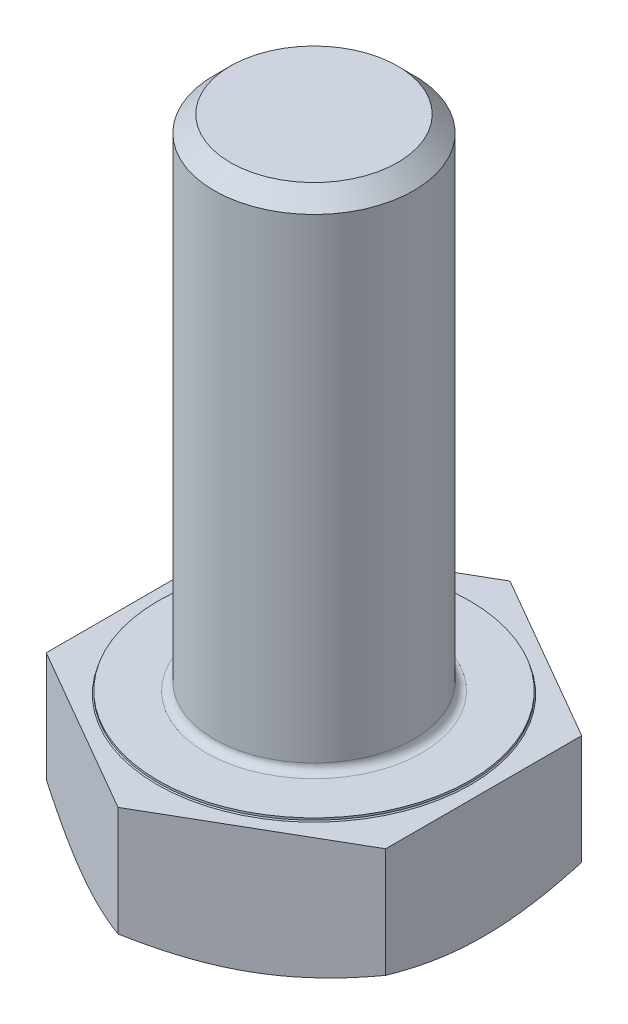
ISO-10303-21;
HEADER;
FILE_DESCRIPTION(('STEP AP214'),'2;1');
FILE_NAME('part.step','',(''),(''),'','','');
FILE_SCHEMA(('AUTOMOTIVE_DESIGN { 1 0 10303 214 1 1 1 1 }'));
ENDSEC;
DATA;
#1=APPLICATION_CONTEXT('core data for automotive mechanical design processes');
#2=APPLICATION_PROTOCOL_DEFINITION('international standard','automotive_design',2000,#1);
#3=PRODUCT_CONTEXT('',#1,'mechanical');
#4=PRODUCT('Part','Part','',(#3));
#5=PRODUCT_RELATED_PRODUCT_CATEGORY('part','',(#4));
#6=PRODUCT_DEFINITION_FORMATION('','',#4);
#7=PRODUCT_DEFINITION_CONTEXT('part definition',#1,'design');
#8=PRODUCT_DEFINITION('design','',#6,#7);
#9=PRODUCT_DEFINITION_SHAPE('','',#8);
#10=(LENGTH_UNIT() NAMED_UNIT(*) SI_UNIT(.MILLI.,.METRE.));
#11=(NAMED_UNIT(*) PLANE_ANGLE_UNIT() SI_UNIT($,.RADIAN.));
#12=(NAMED_UNIT(*) SI_UNIT($,.STERADIAN.) SOLID_ANGLE_UNIT());
#13=UNCERTAINTY_MEASURE_WITH_UNIT(LENGTH_MEASURE(1.E-05),#10,'distance_accuracy_value','');
#14=(GEOMETRIC_REPRESENTATION_CONTEXT(3) GLOBAL_UNCERTAINTY_ASSIGNED_CONTEXT((#13)) GLOBAL_UNIT_ASSIGNED_CONTEXT((#10,
#11,#12)) REPRESENTATION_CONTEXT('',''));
#15=CARTESIAN_POINT('',(0.,0.,0.));
#16=DIRECTION('',(0.,0.,1.));
#17=DIRECTION('',(1.,0.,0.));
#18=AXIS2_PLACEMENT_3D('',#15,#16,#17);
#19=CARTESIAN_POINT('',(0.,-6.4,0.));
#20=DIRECTION('',(0.,-1.,0.));
#21=DIRECTION('',(0.,0.,-1.));
#22=AXIS2_PLACEMENT_3D('',#19,#20,#21);
#23=PLANE('',#22);
#24=CARTESIAN_POINT('',(0.,-6.40000000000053,0.));
#25=DIRECTION('',(0.,1.,0.));
#26=DIRECTION('',(0.,0.,1.));
#27=AXIS2_PLACEMENT_3D('',#24,#25,#26);
#28=CIRCLE('',#27,8.5000000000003);
#29=CARTESIAN_POINT('',(-8.50000000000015,-6.40000000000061,0.));
#30=VERTEX_POINT('',#29);
#31=CARTESIAN_POINT('',(-4.25000000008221,-6.40000000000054,7.36121593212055));
#32=VERTEX_POINT('',#31);
#33=EDGE_CURVE('E174',#30,#32,#28,.T.);
#34=ORIENTED_EDGE('',*,*,#33,.F.);
#35=CARTESIAN_POINT('',(0.,-6.40000000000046,0.));
#36=DIRECTION('',(0.,1.,0.));
#37=DIRECTION('',(0.,0.,1.));
#38=AXIS2_PLACEMENT_3D('',#35,#36,#37);
#39=CIRCLE('',#38,8.50000000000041);
#40=CARTESIAN_POINT('',(-4.2499999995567,-6.4000000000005,-7.36121593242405));
#41=VERTEX_POINT('',#40);
#42=EDGE_CURVE('E59',#41,#30,#39,.T.);
#43=ORIENTED_EDGE('',*,*,#42,.F.);
#44=CARTESIAN_POINT('',(0.,-6.40000000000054,0.));
#45=DIRECTION('',(0.,1.,0.));
#46=DIRECTION('',(0.,0.,1.));
#47=AXIS2_PLACEMENT_3D('',#44,#45,#46);
#48=CIRCLE('',#47,8.50000000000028);
#49=CARTESIAN_POINT('',(4.25000000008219,-6.40000000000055,-7.36121593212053));
#50=VERTEX_POINT('',#49);
#51=EDGE_CURVE('E76',#50,#41,#48,.T.);
#52=ORIENTED_EDGE('',*,*,#51,.F.);
#53=CARTESIAN_POINT('',(0.,-6.40000000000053,0.));
#54=DIRECTION('',(0.,1.,0.));
#55=DIRECTION('',(0.,0.,1.));
#56=AXIS2_PLACEMENT_3D('',#53,#54,#55);
#57=CIRCLE('',#56,8.5000000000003);
#58=CARTESIAN_POINT('',(8.50000000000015,-6.40000000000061,0.));
#59=VERTEX_POINT('',#58);
#60=EDGE_CURVE('E74',#59,#50,#57,.T.);
#61=ORIENTED_EDGE('',*,*,#60,.F.);
#62=CARTESIAN_POINT('',(0.,-6.40000000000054,0.));
#63=DIRECTION('',(0.,1.,0.));
#64=DIRECTION('',(0.,0.,1.));
#65=AXIS2_PLACEMENT_3D('',#62,#63,#64);
#66=CIRCLE('',#65,8.50000000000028);
#67=CARTESIAN_POINT('',(4.25000000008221,-6.40000000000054,7.36121593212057));
#68=VERTEX_POINT('',#67);
#69=EDGE_CURVE('E175',#68,#59,#66,.T.);
#70=ORIENTED_EDGE('',*,*,#69,.F.);
#71=CARTESIAN_POINT('',(0.,-6.40000000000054,0.));
#72=DIRECTION('',(0.,1.,0.));
#73=DIRECTION('',(0.,0.,1.));
#74=AXIS2_PLACEMENT_3D('',#71,#72,#73);
#75=CIRCLE('',#74,8.50000000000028);
#76=EDGE_CURVE('E170',#32,#68,#75,.T.);
#77=ORIENTED_EDGE('',*,*,#76,.F.);
#78=EDGE_LOOP('',(#34,#43,#52,#61,#70,#77));
#79=FACE_BOUND('',#78,.T.);
#80=ADVANCED_FACE('F42',(#79),#23,.T.);
#81=CARTESIAN_POINT('',(0.,-5.63625548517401,0.));
#82=DIRECTION('',(0.,1.,0.));
#83=DIRECTION('',(0.,0.,1.));
#84=AXIS2_PLACEMENT_3D('',#81,#82,#83);
#85=CONICAL_SURFACE('',#84,9.82284430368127,1.0471975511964);
#86=CARTESIAN_POINT('',(8.50000000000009,-5.64081062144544,-4.90747728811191));
#87=CARTESIAN_POINT('',(8.154051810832,-5.75615561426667,-5.10721056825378));
#88=CARTESIAN_POINT('',(7.80533314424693,-5.86183176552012,-5.30854338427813));
#89=CARTESIAN_POINT('',(7.10482189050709,-6.04818975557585,-5.7129837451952));
#90=CARTESIAN_POINT('',(6.75305373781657,-6.12899518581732,-5.91607718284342));
#91=CARTESIAN_POINT('',(6.2220816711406,-6.22821053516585,-6.22263404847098));
#92=CARTESIAN_POINT('',(6.04442025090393,-6.25762889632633,-6.32520691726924));
#93=CARTESIAN_POINT('',(5.68824687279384,-6.30855269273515,-6.53084371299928));
#94=CARTESIAN_POINT('',(5.50973493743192,-6.33005833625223,-6.63390762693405));
#95=CARTESIAN_POINT('',(5.15120023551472,-6.36477884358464,-6.84090773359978));
#96=CARTESIAN_POINT('',(4.97117438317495,-6.37795154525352,-6.94484570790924));
#97=CARTESIAN_POINT('',(4.61076862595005,-6.39558035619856,-7.15292606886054));
#98=CARTESIAN_POINT('',(4.43038865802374,-6.40003473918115,-7.25706849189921));
#99=CARTESIAN_POINT('',(4.25000000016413,-6.40000000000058,-7.36121593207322));
#100=B_SPLINE_CURVE_WITH_KNOTS('',3,(#86,#87,#88,#89,#90,#91,#92,#93,#94,#95,#96,#97,#98,#99),
.UNSPECIFIED.,.F.,.F.,(4,2,2,2,2,2,4),(0.,1.24786231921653,2.4894195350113,3.11101273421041,
3.73258957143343,4.35728675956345,4.98210762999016),.UNSPECIFIED.);
#101=CARTESIAN_POINT('',(8.5,-5.64081062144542,-4.907477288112));
#102=VERTEX_POINT('',#101);
#103=EDGE_CURVE('E159',#102,#50,#100,.T.);
#104=ORIENTED_EDGE('',*,*,#103,.F.);
#105=CARTESIAN_POINT('',(8.5,-6.4000000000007,0.));
#106=CARTESIAN_POINT('',(8.5,-6.40003473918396,-0.208294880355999));
#107=CARTESIAN_POINT('',(8.5,-6.3955803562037,-0.416579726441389));
#108=CARTESIAN_POINT('',(8.5,-6.37795154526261,-0.832740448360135));
#109=CARTESIAN_POINT('',(8.5,-6.36477884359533,-1.04061639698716));
#110=CARTESIAN_POINT('',(8.5,-6.33005833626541,-1.4546166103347));
#111=CARTESIAN_POINT('',(8.5,-6.30855269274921,-1.66074443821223));
#112=CARTESIAN_POINT('',(8.5,-6.25762889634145,-2.07201802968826));
#113=CARTESIAN_POINT('',(8.5,-6.22821053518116,-2.27716376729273));
#114=CARTESIAN_POINT('',(8.5,-6.12899518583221,-2.89027749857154));
#115=CARTESIAN_POINT('',(8.5,-6.04818975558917,-3.29646437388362));
#116=CARTESIAN_POINT('',(8.5,-5.86183176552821,-4.10534509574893));
#117=CARTESIAN_POINT('',(8.5,-5.75615561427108,-4.50801072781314));
#118=CARTESIAN_POINT('',(8.5,-5.64081062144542,-4.90747728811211));
#119=B_SPLINE_CURVE_WITH_KNOTS('',3,(#105,#106,#107,#108,#109,#110,#111,#112,#113,#114,#115,
#116,#117,#118),.UNSPECIFIED.,.F.,.F.,(4,2,2,2,2,2,4),(0.,0.624820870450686,1.24951805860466,
1.87109489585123,2.49268809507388,3.73424531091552,4.98210763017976),.UNSPECIFIED.);
#120=EDGE_CURVE('E309',#59,#102,#119,.T.);
#121=ORIENTED_EDGE('',*,*,#120,.F.);
#122=ORIENTED_EDGE('',*,*,#60,.T.);
#123=EDGE_LOOP('',(#104,#121,#122));
#124=FACE_BOUND('',#123,.T.);
#125=ADVANCED_FACE('F315',(#124),#85,.T.);
#126=CARTESIAN_POINT('',(0.,-5.63625548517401,0.));
#127=DIRECTION('',(0.,1.,0.));
#128=DIRECTION('',(0.,0.,1.));
#129=AXIS2_PLACEMENT_3D('',#126,#127,#128);
#130=CONICAL_SURFACE('',#129,9.82284430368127,1.0471975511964);
#131=CARTESIAN_POINT('',(8.5,-5.64081062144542,4.90747728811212));
#132=CARTESIAN_POINT('',(8.5,-5.75615561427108,4.50801072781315));
#133=CARTESIAN_POINT('',(8.5,-5.86183176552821,4.10534509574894));
#134=CARTESIAN_POINT('',(8.5,-6.04818975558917,3.29646437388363));
#135=CARTESIAN_POINT('',(8.5,-6.12899518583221,2.89027749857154));
#136=CARTESIAN_POINT('',(8.5,-6.22821053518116,2.27716376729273));
#137=CARTESIAN_POINT('',(8.5,-6.25762889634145,2.07201802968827));
#138=CARTESIAN_POINT('',(8.5,-6.3085526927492,1.66074443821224));
#139=CARTESIAN_POINT('',(8.5,-6.33005833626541,1.45461661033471));
#140=CARTESIAN_POINT('',(8.5,-6.36477884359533,1.04061639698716));
#141=CARTESIAN_POINT('',(8.5,-6.37795154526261,0.832740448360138));
#142=CARTESIAN_POINT('',(8.5,-6.3955803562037,0.41657972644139));
#143=CARTESIAN_POINT('',(8.5,-6.40003473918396,0.208294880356));
#144=CARTESIAN_POINT('',(8.5,-6.4000000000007,0.));
#145=B_SPLINE_CURVE_WITH_KNOTS('',3,(#131,#132,#133,#134,#135,#136,#137,#138,#139,#140,#141,
#142,#143,#144),.UNSPECIFIED.,.F.,.F.,(4,2,2,2,2,2,4),(0.,1.24786231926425,2.48941953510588,
3.11101273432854,3.73258957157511,4.35728675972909,4.98210763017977),.UNSPECIFIED.);
#146=CARTESIAN_POINT('',(8.5,-5.64081062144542,4.907477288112));
#147=VERTEX_POINT('',#146);
#148=EDGE_CURVE('E269',#147,#59,#145,.T.);
#149=ORIENTED_EDGE('',*,*,#148,.F.);
#150=CARTESIAN_POINT('',(4.25000000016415,-6.40000000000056,7.36121593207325));
#151=CARTESIAN_POINT('',(4.43038865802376,-6.40003473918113,7.25706849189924));
#152=CARTESIAN_POINT('',(4.61076862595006,-6.39558035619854,7.15292606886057));
#153=CARTESIAN_POINT('',(4.97117438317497,-6.3779515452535,6.94484570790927));
#154=CARTESIAN_POINT('',(5.15120023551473,-6.36477884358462,6.84090773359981));
#155=CARTESIAN_POINT('',(5.50973493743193,-6.33005833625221,6.63390762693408));
#156=CARTESIAN_POINT('',(5.68824687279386,-6.30855269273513,6.53084371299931));
#157=CARTESIAN_POINT('',(6.04442025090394,-6.25762889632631,6.32520691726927));
#158=CARTESIAN_POINT('',(6.22208167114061,-6.22821053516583,6.22263404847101));
#159=CARTESIAN_POINT('',(6.75305373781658,-6.1289951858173,5.91607718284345));
#160=CARTESIAN_POINT('',(7.10482189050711,-6.04818975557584,5.71298374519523));
#161=CARTESIAN_POINT('',(7.80533314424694,-5.86183176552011,5.30854338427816));
#162=CARTESIAN_POINT('',(8.15405181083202,-5.75615561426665,5.10721056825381));
#163=CARTESIAN_POINT('',(8.50000000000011,-5.64081062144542,4.90747728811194));
#164=B_SPLINE_CURVE_WITH_KNOTS('',3,(#150,#151,#152,#153,#154,#155,#156,#157,#158,#159,#160,
#161,#162,#163),.UNSPECIFIED.,.F.,.F.,(4,2,2,2,2,2,4),(0.,0.624820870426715,1.24951805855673,
1.87109489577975,2.49268809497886,3.73424531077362,4.98210762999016),.UNSPECIFIED.);
#165=EDGE_CURVE('E244',#68,#147,#164,.T.);
#166=ORIENTED_EDGE('',*,*,#165,.F.);
#167=ORIENTED_EDGE('',*,*,#69,.T.);
#168=EDGE_LOOP('',(#149,#166,#167));
#169=FACE_BOUND('',#168,.T.);
#170=ADVANCED_FACE('F277',(#169),#130,.T.);
#171=CARTESIAN_POINT('',(0.,-5.63625548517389,0.));
#172=DIRECTION('',(0.,1.,0.));
#173=DIRECTION('',(0.,0.,1.));
#174=AXIS2_PLACEMENT_3D('',#171,#172,#173);
#175=CONICAL_SURFACE('',#174,9.82284430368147,1.0471975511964);
#176=CARTESIAN_POINT('',(0.,-5.64081062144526,9.81495457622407));
#177=CARTESIAN_POINT('',(0.34594818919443,-5.75615561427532,9.61522129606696));
#178=CARTESIAN_POINT('',(0.694666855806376,-5.86183176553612,9.4138884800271));
#179=CARTESIAN_POINT('',(1.39517810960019,-6.04818975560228,9.00944811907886));
#180=CARTESIAN_POINT('',(1.74694626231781,-6.12899518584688,8.806354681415));
#181=CARTESIAN_POINT('',(2.27791832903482,-6.22821053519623,8.49979781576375));
#182=CARTESIAN_POINT('',(2.45557974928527,-6.25762889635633,8.39722494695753));
#183=CARTESIAN_POINT('',(2.81175312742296,-6.30855269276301,8.19158815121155));
#184=CARTESIAN_POINT('',(2.99026506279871,-6.33005833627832,8.08852423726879));
#185=CARTESIAN_POINT('',(3.34879976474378,-6.36477884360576,7.88152413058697));
#186=CARTESIAN_POINT('',(3.52882561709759,-6.37795154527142,7.77758615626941));
#187=CARTESIAN_POINT('',(3.88923137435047,-6.39558035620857,7.56950579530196));
#188=CARTESIAN_POINT('',(4.0696113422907,-6.4000347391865,7.46536337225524));
#189=CARTESIAN_POINT('',(4.25000000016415,-6.40000000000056,7.36121593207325));
#190=B_SPLINE_CURVE_WITH_KNOTS('',3,(#176,#177,#178,#179,#180,#181,#182,#183,#184,#185,#186,
#187,#188,#189),.UNSPECIFIED.,.F.,.F.,(4,2,2,2,2,2,4),(0.,1.24786231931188,2.4894195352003,
3.11101273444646,3.73258957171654,4.35728675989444,4.98210763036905),.UNSPECIFIED.);
#191=CARTESIAN_POINT('',(0.,-5.64081062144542,9.814954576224));
#192=VERTEX_POINT('',#191);
#193=EDGE_CURVE('E287',#192,#68,#190,.T.);
#194=ORIENTED_EDGE('',*,*,#193,.F.);
#195=CARTESIAN_POINT('',(-4.25000000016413,-6.40000000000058,7.36121593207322));
#196=CARTESIAN_POINT('',(-4.06961134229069,-6.40003473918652,7.46536337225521));
#197=CARTESIAN_POINT('',(-3.88923137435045,-6.39558035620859,7.56950579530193));
#198=CARTESIAN_POINT('',(-3.52882561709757,-6.37795154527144,7.77758615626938));
#199=CARTESIAN_POINT('',(-3.34879976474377,-6.36477884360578,7.88152413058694));
#200=CARTESIAN_POINT('',(-2.9902650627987,-6.33005833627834,8.08852423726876));
#201=CARTESIAN_POINT('',(-2.81175312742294,-6.30855269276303,8.19158815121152));
#202=CARTESIAN_POINT('',(-2.45557974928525,-6.25762889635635,8.39722494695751));
#203=CARTESIAN_POINT('',(-2.2779183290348,-6.22821053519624,8.49979781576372));
#204=CARTESIAN_POINT('',(-1.74694626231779,-6.1289951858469,8.80635468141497));
#205=CARTESIAN_POINT('',(-1.39517810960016,-6.0481897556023,9.00944811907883));
#206=CARTESIAN_POINT('',(-0.694666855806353,-5.86183176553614,9.41388848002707));
#207=CARTESIAN_POINT('',(-0.345948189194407,-5.75615561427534,9.61522129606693));
#208=CARTESIAN_POINT('',(0.,-5.64081062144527,9.81495457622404));
#209=B_SPLINE_CURVE_WITH_KNOTS('',3,(#195,#196,#197,#198,#199,#200,#201,#202,#203,#204,#205,
#206,#207,#208),.UNSPECIFIED.,.F.,.F.,(4,2,2,2,2,2,4),(0.,0.62482087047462,1.24951805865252,
1.87109489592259,2.49268809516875,3.73424531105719,4.98210763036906),.UNSPECIFIED.);
#210=EDGE_CURVE('E243',#32,#192,#209,.T.);
#211=ORIENTED_EDGE('',*,*,#210,.F.);
#212=ORIENTED_EDGE('',*,*,#76,.T.);
#213=EDGE_LOOP('',(#194,#211,#212));
#214=FACE_BOUND('',#213,.T.);
#215=ADVANCED_FACE('F273',(#214),#175,.T.);
#216=CARTESIAN_POINT('',(0.,-5.63625548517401,0.));
#217=DIRECTION('',(0.,1.,0.));
#218=DIRECTION('',(0.,0.,1.));
#219=AXIS2_PLACEMENT_3D('',#216,#217,#218);
#220=CONICAL_SURFACE('',#219,9.82284430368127,1.0471975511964);
#221=CARTESIAN_POINT('',(-8.50000000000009,-5.64081062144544,4.90747728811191));
#222=CARTESIAN_POINT('',(-8.154051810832,-5.75615561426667,5.10721056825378));
#223=CARTESIAN_POINT('',(-7.80533314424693,-5.86183176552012,5.30854338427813));
#224=CARTESIAN_POINT('',(-7.10482189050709,-6.04818975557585,5.7129837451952));
#225=CARTESIAN_POINT('',(-6.75305373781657,-6.12899518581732,5.91607718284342));
#226=CARTESIAN_POINT('',(-6.2220816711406,-6.22821053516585,6.22263404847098));
#227=CARTESIAN_POINT('',(-6.04442025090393,-6.25762889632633,6.32520691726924));
#228=CARTESIAN_POINT('',(-5.68824687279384,-6.30855269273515,6.53084371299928));
#229=CARTESIAN_POINT('',(-5.50973493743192,-6.33005833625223,6.63390762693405));
#230=CARTESIAN_POINT('',(-5.15120023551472,-6.36477884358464,6.84090773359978));
#231=CARTESIAN_POINT('',(-4.97117438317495,-6.37795154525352,6.94484570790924));
#232=CARTESIAN_POINT('',(-4.61076862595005,-6.39558035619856,7.15292606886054));
#233=CARTESIAN_POINT('',(-4.43038865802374,-6.40003473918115,7.25706849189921));
#234=CARTESIAN_POINT('',(-4.25000000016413,-6.40000000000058,7.36121593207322));
#235=B_SPLINE_CURVE_WITH_KNOTS('',3,(#221,#222,#223,#224,#225,#226,#227,#228,#229,#230,#231,
#232,#233,#234),.UNSPECIFIED.,.F.,.F.,(4,2,2,2,2,2,4),(0.,1.24786231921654,2.4894195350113,
3.11101273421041,3.73258957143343,4.35728675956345,4.98210762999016),.UNSPECIFIED.);
#236=CARTESIAN_POINT('',(-8.5,-5.64081062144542,4.90747728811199));
#237=VERTEX_POINT('',#236);
#238=EDGE_CURVE('E239',#237,#32,#235,.T.);
#239=ORIENTED_EDGE('',*,*,#238,.F.);
#240=CARTESIAN_POINT('',(-8.5,-6.4000000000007,0.));
#241=CARTESIAN_POINT('',(-8.5,-6.40003473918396,0.208294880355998));
#242=CARTESIAN_POINT('',(-8.5,-6.3955803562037,0.416579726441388));
#243=CARTESIAN_POINT('',(-8.5,-6.37795154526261,0.832740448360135));
#244=CARTESIAN_POINT('',(-8.5,-6.36477884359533,1.04061639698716));
#245=CARTESIAN_POINT('',(-8.5,-6.33005833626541,1.4546166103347));
#246=CARTESIAN_POINT('',(-8.5,-6.30855269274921,1.66074443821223));
#247=CARTESIAN_POINT('',(-8.5,-6.25762889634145,2.07201802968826));
#248=CARTESIAN_POINT('',(-8.5,-6.22821053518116,2.27716376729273));
#249=CARTESIAN_POINT('',(-8.5,-6.12899518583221,2.89027749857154));
#250=CARTESIAN_POINT('',(-8.5,-6.04818975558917,3.29646437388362));
#251=CARTESIAN_POINT('',(-8.5,-5.86183176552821,4.10534509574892));
#252=CARTESIAN_POINT('',(-8.5,-5.75615561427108,4.50801072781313));
#253=CARTESIAN_POINT('',(-8.5,-5.64081062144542,4.90747728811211));
#254=B_SPLINE_CURVE_WITH_KNOTS('',3,(#240,#241,#242,#243,#244,#245,#246,#247,#248,#249,#250,
#251,#252,#253),.UNSPECIFIED.,.F.,.F.,(4,2,2,2,2,2,4),(0.,0.624820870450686,1.24951805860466,
1.87109489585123,2.49268809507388,3.73424531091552,4.98210763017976),.UNSPECIFIED.);
#255=EDGE_CURVE('E250',#30,#237,#254,.T.);
#256=ORIENTED_EDGE('',*,*,#255,.F.);
#257=ORIENTED_EDGE('',*,*,#33,.T.);
#258=EDGE_LOOP('',(#239,#256,#257));
#259=FACE_BOUND('',#258,.T.);
#260=ADVANCED_FACE('F207',(#259),#220,.T.);
#261=CARTESIAN_POINT('',(0.,-5.63625548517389,0.));
#262=DIRECTION('',(0.,1.,0.));
#263=DIRECTION('',(0.,0.,1.));
#264=AXIS2_PLACEMENT_3D('',#261,#262,#263);
#265=CONICAL_SURFACE('',#264,9.82284430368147,1.0471975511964);
#266=CARTESIAN_POINT('',(0.,-5.64081062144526,-9.81495457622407));
#267=CARTESIAN_POINT('',(-0.345948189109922,-5.75615561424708,-9.61522129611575));
#268=CARTESIAN_POINT('',(-0.694666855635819,-5.86183176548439,-9.41388848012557));
#269=CARTESIAN_POINT('',(-1.39517810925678,-6.04818975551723,-9.00944811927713));
#270=CARTESIAN_POINT('',(-1.74694626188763,-6.12899518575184,-8.80635468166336));
#271=CARTESIAN_POINT('',(-2.27791832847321,-6.22821053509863,-8.49979781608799));
#272=CARTESIAN_POINT('',(-2.45557974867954,-6.25762889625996,-8.39722494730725));
#273=CARTESIAN_POINT('',(-2.81175312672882,-6.30855269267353,-8.19158815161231));
#274=CARTESIAN_POINT('',(-2.99026506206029,-6.33005833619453,-8.08852423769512));
#275=CARTESIAN_POINT('',(-3.34879976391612,-6.36477884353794,-7.88152413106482));
#276=CARTESIAN_POINT('',(-3.52882561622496,-6.37795154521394,-7.77758615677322));
#277=CARTESIAN_POINT('',(-3.88923137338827,-6.3955803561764,-7.56950579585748));
#278=CARTESIAN_POINT('',(-4.0696113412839,-6.40003473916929,-7.46536337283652));
#279=CARTESIAN_POINT('',(-4.24999999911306,-6.40000000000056,-7.3612159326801));
#280=B_SPLINE_CURVE_WITH_KNOTS('',3,(#266,#267,#268,#269,#270,#271,#272,#273,#274,#275,#276,
#277,#278,#279),.UNSPECIFIED.,.F.,.F.,(4,2,2,2,2,2,4),(0.,1.24786231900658,2.4894195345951,
3.1110127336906,3.73258957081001,4.35728675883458,4.98210762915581),.UNSPECIFIED.);
#281=CARTESIAN_POINT('',(0.,-5.64081062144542,-9.814954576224));
#282=VERTEX_POINT('',#281);
#283=EDGE_CURVE('E196',#282,#41,#280,.T.);
#284=ORIENTED_EDGE('',*,*,#283,.F.);
#285=CARTESIAN_POINT('',(4.25000000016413,-6.40000000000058,-7.36121593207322));
#286=CARTESIAN_POINT('',(4.06961134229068,-6.40003473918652,-7.46536337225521));
#287=CARTESIAN_POINT('',(3.88923137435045,-6.39558035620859,-7.56950579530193));
#288=CARTESIAN_POINT('',(3.52882561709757,-6.37795154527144,-7.77758615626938));
#289=CARTESIAN_POINT('',(3.34879976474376,-6.36477884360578,-7.88152413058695));
#290=CARTESIAN_POINT('',(2.99026506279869,-6.33005833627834,-8.08852423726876));
#291=CARTESIAN_POINT('',(2.81175312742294,-6.30855269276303,-8.19158815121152));
#292=CARTESIAN_POINT('',(2.45557974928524,-6.25762889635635,-8.39722494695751));
#293=CARTESIAN_POINT('',(2.2779183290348,-6.22821053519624,-8.49979781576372));
#294=CARTESIAN_POINT('',(1.74694626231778,-6.12899518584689,-8.80635468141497));
#295=CARTESIAN_POINT('',(1.39517810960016,-6.0481897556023,-9.00944811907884));
#296=CARTESIAN_POINT('',(0.694666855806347,-5.86183176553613,-9.41388848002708));
#297=CARTESIAN_POINT('',(0.345948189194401,-5.75615561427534,-9.61522129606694));
#298=CARTESIAN_POINT('',(0.,-5.64081062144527,-9.81495457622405));
#299=B_SPLINE_CURVE_WITH_KNOTS('',3,(#285,#286,#287,#288,#289,#290,#291,#292,#293,#294,#295,
#296,#297,#298),.UNSPECIFIED.,.F.,.F.,(4,2,2,2,2,2,4),(0.,0.624820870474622,1.24951805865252,
1.8710948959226,2.49268809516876,3.73424531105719,4.98210763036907),.UNSPECIFIED.);
#300=EDGE_CURVE('E144',#50,#282,#299,.T.);
#301=ORIENTED_EDGE('',*,*,#300,.F.);
#302=ORIENTED_EDGE('',*,*,#51,.T.);
#303=EDGE_LOOP('',(#284,#301,#302));
#304=FACE_BOUND('',#303,.T.);
#305=ADVANCED_FACE('F202',(#304),#265,.T.);
#306=CARTESIAN_POINT('',(0.,-5.63625548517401,0.));
#307=DIRECTION('',(0.,1.,0.));
#308=DIRECTION('',(0.,0.,1.));
#309=AXIS2_PLACEMENT_3D('',#306,#307,#308);
#310=CONICAL_SURFACE('',#309,9.82284430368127,1.0471975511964);
#311=CARTESIAN_POINT('',(-8.5,-5.64081062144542,-4.90747728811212));
#312=CARTESIAN_POINT('',(-8.5,-5.75615561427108,-4.50801072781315));
#313=CARTESIAN_POINT('',(-8.5,-5.86183176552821,-4.10534509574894));
#314=CARTESIAN_POINT('',(-8.5,-6.04818975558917,-3.29646437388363));
#315=CARTESIAN_POINT('',(-8.5,-6.12899518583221,-2.89027749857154));
#316=CARTESIAN_POINT('',(-8.5,-6.22821053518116,-2.27716376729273));
#317=CARTESIAN_POINT('',(-8.5,-6.25762889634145,-2.07201802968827));
#318=CARTESIAN_POINT('',(-8.5,-6.3085526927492,-1.66074443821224));
#319=CARTESIAN_POINT('',(-8.5,-6.33005833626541,-1.45461661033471));
#320=CARTESIAN_POINT('',(-8.5,-6.36477884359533,-1.04061639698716));
#321=CARTESIAN_POINT('',(-8.5,-6.37795154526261,-0.832740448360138));
#322=CARTESIAN_POINT('',(-8.5,-6.3955803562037,-0.41657972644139));
#323=CARTESIAN_POINT('',(-8.5,-6.40003473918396,-0.208294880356));
#324=CARTESIAN_POINT('',(-8.5,-6.4000000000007,0.));
#325=B_SPLINE_CURVE_WITH_KNOTS('',3,(#311,#312,#313,#314,#315,#316,#317,#318,#319,#320,#321,
#322,#323,#324),.UNSPECIFIED.,.F.,.F.,(4,2,2,2,2,2,4),(0.,1.24786231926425,2.48941953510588,
3.11101273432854,3.73258957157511,4.35728675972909,4.98210763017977),.UNSPECIFIED.);
#326=CARTESIAN_POINT('',(-8.5,-5.64081062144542,-4.907477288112));
#327=VERTEX_POINT('',#326);
#328=EDGE_CURVE('E219',#327,#30,#325,.T.);
#329=ORIENTED_EDGE('',*,*,#328,.F.);
#330=CARTESIAN_POINT('',(-4.24999999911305,-6.40000000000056,-7.3612159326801));
#331=CARTESIAN_POINT('',(-4.43038865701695,-6.40003473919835,-7.25706849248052));
#332=CARTESIAN_POINT('',(-4.61076862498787,-6.39558035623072,-7.15292606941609));
#333=CARTESIAN_POINT('',(-4.97117438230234,-6.37795154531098,-6.94484570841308));
#334=CARTESIAN_POINT('',(-5.15120023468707,-6.36477884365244,-6.84090773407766));
#335=CARTESIAN_POINT('',(-5.50973493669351,-6.33005833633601,-6.63390762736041));
#336=CARTESIAN_POINT('',(-5.68824687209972,-6.30855269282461,-6.53084371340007));
#337=CARTESIAN_POINT('',(-6.04442025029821,-6.25762889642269,-6.32520691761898));
#338=CARTESIAN_POINT('',(-6.222081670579,-6.22821053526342,-6.22263404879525));
#339=CARTESIAN_POINT('',(-6.7530537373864,-6.12899518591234,-5.91607718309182));
#340=CARTESIAN_POINT('',(-7.1048218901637,-6.04818975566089,-5.7129837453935));
#341=CARTESIAN_POINT('',(-7.80533314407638,-5.86183176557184,-5.30854338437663));
#342=CARTESIAN_POINT('',(-8.1540518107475,-5.7561556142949,-5.1072105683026));
#343=CARTESIAN_POINT('',(-8.5000000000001,-5.64081062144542,-4.90747728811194));
#344=B_SPLINE_CURVE_WITH_KNOTS('',3,(#330,#331,#332,#333,#334,#335,#336,#337,#338,#339,#340,
#341,#342,#343),.UNSPECIFIED.,.F.,.F.,(4,2,2,2,2,2,4),(0.,0.624820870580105,1.24951805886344,
1.87109489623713,2.49268809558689,3.73424531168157,4.98210763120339),.UNSPECIFIED.);
#345=EDGE_CURVE('E238',#41,#327,#344,.T.);
#346=ORIENTED_EDGE('',*,*,#345,.F.);
#347=ORIENTED_EDGE('',*,*,#42,.T.);
#348=EDGE_LOOP('',(#329,#346,#347));
#349=FACE_BOUND('',#348,.T.);
#350=ADVANCED_FACE('F206',(#349),#310,.T.);
#351=CARTESIAN_POINT('',(0.,0.,-9.814954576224));
#352=DIRECTION('',(0.500000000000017,0.,-0.866025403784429));
#353=DIRECTION('',(-0.866025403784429,0.,-0.500000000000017));
#354=AXIS2_PLACEMENT_3D('',#351,#352,#353);
#355=PLANE('',#354);
#356=ORIENTED_EDGE('',*,*,#300,.T.);
#357=DIRECTION('',(0.,-1.,0.));
#358=VECTOR('',#357,1.);
#359=CARTESIAN_POINT('',(0.,-0.15,-9.814954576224));
#360=LINE('',#359,#358);
#361=CARTESIAN_POINT('',(0.,-0.15,-9.814954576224));
#362=VERTEX_POINT('',#361);
#363=EDGE_CURVE('E140',#362,#282,#360,.T.);
#364=ORIENTED_EDGE('',*,*,#363,.F.);
#365=DIRECTION('',(-0.866025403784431,0.,-0.500000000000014));
#366=VECTOR('',#365,1.);
#367=CARTESIAN_POINT('',(0.,-0.15,-9.814954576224));
#368=LINE('',#367,#366);
#369=CARTESIAN_POINT('',(8.5,-0.15,-4.907477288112));
#370=VERTEX_POINT('',#369);
#371=EDGE_CURVE('E129',#370,#362,#368,.T.);
#372=ORIENTED_EDGE('',*,*,#371,.F.);
#373=DIRECTION('',(0.,-1.,0.));
#374=VECTOR('',#373,1.);
#375=CARTESIAN_POINT('',(8.5,-0.15,-4.907477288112));
#376=LINE('',#375,#374);
#377=EDGE_CURVE('E148',#370,#102,#376,.T.);
#378=ORIENTED_EDGE('',*,*,#377,.T.);
#379=ORIENTED_EDGE('',*,*,#103,.T.);
#380=EDGE_LOOP('',(#356,#364,#372,#378,#379));
#381=FACE_BOUND('',#380,.T.);
#382=ADVANCED_FACE('F141',(#381),#355,.T.);
#383=CARTESIAN_POINT('',(8.5,0.,-4.907477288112));
#384=DIRECTION('',(1.,0.,0.));
#385=DIRECTION('',(0.,0.,-1.));
#386=AXIS2_PLACEMENT_3D('',#383,#384,#385);
#387=PLANE('',#386);
#388=ORIENTED_EDGE('',*,*,#120,.T.);
#389=ORIENTED_EDGE('',*,*,#377,.F.);
#390=DIRECTION('',(0.,0.,-1.));
#391=VECTOR('',#390,1.);
#392=CARTESIAN_POINT('',(8.5,-0.15,-4.907477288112));
#393=LINE('',#392,#391);
#394=CARTESIAN_POINT('',(8.5,-0.15,4.907477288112));
#395=VERTEX_POINT('',#394);
#396=EDGE_CURVE('E135',#395,#370,#393,.T.);
#397=ORIENTED_EDGE('',*,*,#396,.F.);
#398=DIRECTION('',(0.,-1.,0.));
#399=VECTOR('',#398,1.);
#400=CARTESIAN_POINT('',(8.5,-0.15,4.907477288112));
#401=LINE('',#400,#399);
#402=EDGE_CURVE('E697',#395,#147,#401,.T.);
#403=ORIENTED_EDGE('',*,*,#402,.T.);
#404=ORIENTED_EDGE('',*,*,#148,.T.);
#405=EDGE_LOOP('',(#388,#389,#397,#403,#404));
#406=FACE_BOUND('',#405,.T.);
#407=ADVANCED_FACE('F313',(#406),#387,.T.);
#408=CARTESIAN_POINT('',(8.5,0.,4.907477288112));
#409=DIRECTION('',(0.500000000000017,0.,0.866025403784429));
#410=DIRECTION('',(0.866025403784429,0.,-0.500000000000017));
#411=AXIS2_PLACEMENT_3D('',#408,#409,#410);
#412=PLANE('',#411);
#413=ORIENTED_EDGE('',*,*,#165,.T.);
#414=ORIENTED_EDGE('',*,*,#402,.F.);
#415=DIRECTION('',(0.866025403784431,0.,-0.500000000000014));
#416=VECTOR('',#415,1.);
#417=CARTESIAN_POINT('',(8.5,-0.15,4.907477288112));
#418=LINE('',#417,#416);
#419=CARTESIAN_POINT('',(0.,-0.15,9.814954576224));
#420=VERTEX_POINT('',#419);
#421=EDGE_CURVE('E122',#420,#395,#418,.T.);
#422=ORIENTED_EDGE('',*,*,#421,.F.);
#423=DIRECTION('',(0.,-1.,0.));
#424=VECTOR('',#423,1.);
#425=CARTESIAN_POINT('',(0.,-0.15,9.814954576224));
#426=LINE('',#425,#424);
#427=EDGE_CURVE('E183',#420,#192,#426,.T.);
#428=ORIENTED_EDGE('',*,*,#427,.T.);
#429=ORIENTED_EDGE('',*,*,#193,.T.);
#430=EDGE_LOOP('',(#413,#414,#422,#428,#429));
#431=FACE_BOUND('',#430,.T.);
#432=ADVANCED_FACE('F258',(#431),#412,.T.);
#433=CARTESIAN_POINT('',(0.,0.,9.814954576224));
#434=DIRECTION('',(-0.500000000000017,0.,0.866025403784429));
#435=DIRECTION('',(0.866025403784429,0.,0.500000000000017));
#436=AXIS2_PLACEMENT_3D('',#433,#434,#435);
#437=PLANE('',#436);
#438=ORIENTED_EDGE('',*,*,#210,.T.);
#439=ORIENTED_EDGE('',*,*,#427,.F.);
#440=DIRECTION('',(0.86602540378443,0.,0.500000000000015));
#441=VECTOR('',#440,1.);
#442=CARTESIAN_POINT('',(0.,-0.15,9.814954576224));
#443=LINE('',#442,#441);
#444=CARTESIAN_POINT('',(-8.5,-0.15,4.90747728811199));
#445=VERTEX_POINT('',#444);
#446=EDGE_CURVE('E711',#445,#420,#443,.T.);
#447=ORIENTED_EDGE('',*,*,#446,.F.);
#448=DIRECTION('',(0.,-1.,0.));
#449=VECTOR('',#448,1.);
#450=CARTESIAN_POINT('',(-8.5,-0.15,4.90747728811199));
#451=LINE('',#450,#449);
#452=EDGE_CURVE('E114',#445,#237,#451,.T.);
#453=ORIENTED_EDGE('',*,*,#452,.T.);
#454=ORIENTED_EDGE('',*,*,#238,.T.);
#455=EDGE_LOOP('',(#438,#439,#447,#453,#454));
#456=FACE_BOUND('',#455,.T.);
#457=ADVANCED_FACE('F254',(#456),#437,.T.);
#458=CARTESIAN_POINT('',(-8.5,0.,4.907477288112));
#459=DIRECTION('',(-1.,0.,0.));
#460=DIRECTION('',(0.,0.,1.));
#461=AXIS2_PLACEMENT_3D('',#458,#459,#460);
#462=PLANE('',#461);
#463=ORIENTED_EDGE('',*,*,#255,.T.);
#464=ORIENTED_EDGE('',*,*,#452,.F.);
#465=DIRECTION('',(0.,0.,1.));
#466=VECTOR('',#465,1.);
#467=CARTESIAN_POINT('',(-8.5,-0.15,4.90747728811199));
#468=LINE('',#467,#466);
#469=CARTESIAN_POINT('',(-8.5,-0.15,-4.907477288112));
#470=VERTEX_POINT('',#469);
#471=EDGE_CURVE('E91',#470,#445,#468,.T.);
#472=ORIENTED_EDGE('',*,*,#471,.F.);
#473=DIRECTION('',(0.,-1.,0.));
#474=VECTOR('',#473,1.);
#475=CARTESIAN_POINT('',(-8.5,-0.15,-4.907477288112));
#476=LINE('',#475,#474);
#477=EDGE_CURVE('E83',#470,#327,#476,.T.);
#478=ORIENTED_EDGE('',*,*,#477,.T.);
#479=ORIENTED_EDGE('',*,*,#328,.T.);
#480=EDGE_LOOP('',(#463,#464,#472,#478,#479));
#481=FACE_BOUND('',#480,.T.);
#482=ADVANCED_FACE('F227',(#481),#462,.T.);
#483=CARTESIAN_POINT('',(-8.5,0.,-4.907477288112));
#484=DIRECTION('',(-0.500000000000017,0.,-0.866025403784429));
#485=DIRECTION('',(-0.866025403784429,0.,0.500000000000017));
#486=AXIS2_PLACEMENT_3D('',#483,#484,#485);
#487=PLANE('',#486);
#488=ORIENTED_EDGE('',*,*,#345,.T.);
#489=ORIENTED_EDGE('',*,*,#477,.F.);
#490=DIRECTION('',(-0.866025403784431,0.,0.500000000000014));
#491=VECTOR('',#490,1.);
#492=CARTESIAN_POINT('',(-8.5,-0.15,-4.907477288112));
#493=LINE('',#492,#491);
#494=EDGE_CURVE('E133',#362,#470,#493,.T.);
#495=ORIENTED_EDGE('',*,*,#494,.F.);
#496=ORIENTED_EDGE('',*,*,#363,.T.);
#497=ORIENTED_EDGE('',*,*,#283,.T.);
#498=EDGE_LOOP('',(#488,#489,#495,#496,#497));
#499=FACE_BOUND('',#498,.T.);
#500=ADVANCED_FACE('F151',(#499),#487,.T.);
#501=CARTESIAN_POINT('',(0.,-0.15,0.));
#502=DIRECTION('',(0.,-1.,0.));
#503=DIRECTION('',(0.,0.,-1.));
#504=AXIS2_PLACEMENT_3D('',#501,#502,#503);
#505=PLANE('',#504);
#506=CARTESIAN_POINT('',(0.,-0.15,0.));
#507=DIRECTION('',(0.,-1.,0.));
#508=DIRECTION('',(0.,0.,-1.));
#509=AXIS2_PLACEMENT_3D('',#506,#507,#508);
#510=CIRCLE('',#509,7.85);
#511=CARTESIAN_POINT('',(0.,-0.15,-7.85));
#512=VERTEX_POINT('',#511);
#513=EDGE_CURVE('E481',#512,#512,#510,.T.);
#514=ORIENTED_EDGE('',*,*,#513,.T.);
#515=EDGE_LOOP('',(#514));
#516=FACE_BOUND('',#515,.T.);
#517=ORIENTED_EDGE('',*,*,#446,.T.);
#518=ORIENTED_EDGE('',*,*,#421,.T.);
#519=ORIENTED_EDGE('',*,*,#396,.T.);
#520=ORIENTED_EDGE('',*,*,#371,.T.);
#521=ORIENTED_EDGE('',*,*,#494,.T.);
#522=ORIENTED_EDGE('',*,*,#471,.T.);
#523=EDGE_LOOP('',(#517,#518,#519,#520,#521,#522));
#524=FACE_BOUND('',#523,.T.);
#525=ADVANCED_FACE('F131',(#516,#524),#505,.F.);
#526=CARTESIAN_POINT('',(0.,25.,0.));
#527=DIRECTION('',(0.,-1.,0.));
#528=DIRECTION('',(0.,0.,-1.));
#529=AXIS2_PLACEMENT_3D('',#526,#527,#528);
#530=CYLINDRICAL_SURFACE('',#529,5.);
#531=CARTESIAN_POINT('',(0.,0.400000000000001,0.));
#532=DIRECTION('',(0.,1.,0.));
#533=DIRECTION('',(0.,0.,1.));
#534=AXIS2_PLACEMENT_3D('',#531,#532,#533);
#535=CIRCLE('',#534,5.);
#536=CARTESIAN_POINT('',(0.,0.400000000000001,5.));
#537=VERTEX_POINT('',#536);
#538=EDGE_CURVE('E13',#537,#537,#535,.T.);
#539=ORIENTED_EDGE('',*,*,#538,.T.);
#540=EDGE_LOOP('',(#539));
#541=FACE_BOUND('',#540,.T.);
#542=CARTESIAN_POINT('',(0.,24.1881250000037,0.));
#543=DIRECTION('',(0.,1.,0.));
#544=DIRECTION('',(0.,0.,1.));
#545=AXIS2_PLACEMENT_3D('',#542,#543,#544);
#546=CIRCLE('',#545,5.);
#547=CARTESIAN_POINT('',(0.,24.1881250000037,5.));
#548=VERTEX_POINT('',#547);
#549=EDGE_CURVE('E471',#548,#548,#546,.F.);
#550=ORIENTED_EDGE('',*,*,#549,.T.);
#551=EDGE_LOOP('',(#550));
#552=FACE_BOUND('',#551,.T.);
#553=ADVANCED_FACE('F506',(#541,#552),#530,.T.);
#554=CARTESIAN_POINT('',(5.,25.,0.));
#555=DIRECTION('',(0.,1.,0.));
#556=DIRECTION('',(0.,0.,1.));
#557=AXIS2_PLACEMENT_3D('',#554,#555,#556);
#558=PLANE('',#557);
#559=CARTESIAN_POINT('',(0.,25.,0.));
#560=DIRECTION('',(0.,1.,0.));
#561=DIRECTION('',(0.,0.,1.));
#562=AXIS2_PLACEMENT_3D('',#559,#560,#561);
#563=CIRCLE('',#562,4.1881250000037);
#564=CARTESIAN_POINT('',(0.,25.,4.1881250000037));
#565=VERTEX_POINT('',#564);
#566=EDGE_CURVE('E476',#565,#565,#563,.T.);
#567=ORIENTED_EDGE('',*,*,#566,.T.);
#568=EDGE_LOOP('',(#567));
#569=FACE_BOUND('',#568,.T.);
#570=ADVANCED_FACE('F508',(#569),#558,.T.);
#571=CARTESIAN_POINT('',(0.,25.,0.));
#572=DIRECTION('',(0.,-1.,0.));
#573=DIRECTION('',(0.,0.,-1.));
#574=AXIS2_PLACEMENT_3D('',#571,#572,#573);
#575=CYLINDRICAL_SURFACE('',#574,7.8);
#576=CARTESIAN_POINT('',(0.,-0.099999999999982,0.));
#577=DIRECTION('',(0.,-1.,0.));
#578=DIRECTION('',(0.,0.,-1.));
#579=AXIS2_PLACEMENT_3D('',#576,#577,#578);
#580=CIRCLE('',#579,7.8);
#581=CARTESIAN_POINT('',(0.,-0.099999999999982,-7.8));
#582=VERTEX_POINT('',#581);
#583=EDGE_CURVE('E488',#582,#582,#580,.F.);
#584=ORIENTED_EDGE('',*,*,#583,.T.);
#585=EDGE_LOOP('',(#584));
#586=FACE_BOUND('',#585,.T.);
#587=CARTESIAN_POINT('',(0.,0.,0.));
#588=DIRECTION('',(0.,-1.,0.));
#589=DIRECTION('',(0.,0.,-1.));
#590=AXIS2_PLACEMENT_3D('',#587,#588,#589);
#591=CIRCLE('',#590,7.8);
#592=CARTESIAN_POINT('',(0.,0.,-7.8));
#593=VERTEX_POINT('',#592);
#594=EDGE_CURVE('E712',#593,#593,#591,.T.);
#595=ORIENTED_EDGE('',*,*,#594,.T.);
#596=EDGE_LOOP('',(#595));
#597=FACE_BOUND('',#596,.T.);
#598=ADVANCED_FACE('F513',(#586,#597),#575,.T.);
#599=CARTESIAN_POINT('',(7.8,0.,0.));
#600=DIRECTION('',(0.,1.,0.));
#601=DIRECTION('',(0.,0.,1.));
#602=AXIS2_PLACEMENT_3D('',#599,#600,#601);
#603=PLANE('',#602);
#604=CARTESIAN_POINT('',(0.,0.,0.));
#605=DIRECTION('',(0.,1.,0.));
#606=DIRECTION('',(0.,0.,1.));
#607=AXIS2_PLACEMENT_3D('',#604,#605,#606);
#608=CIRCLE('',#607,5.4);
#609=CARTESIAN_POINT('',(0.,0.,5.4));
#610=VERTEX_POINT('',#609);
#611=EDGE_CURVE('E51',#610,#610,#608,.F.);
#612=ORIENTED_EDGE('',*,*,#611,.T.);
#613=EDGE_LOOP('',(#612));
#614=FACE_BOUND('',#613,.T.);
#615=ORIENTED_EDGE('',*,*,#594,.F.);
#616=EDGE_LOOP('',(#615));
#617=FACE_BOUND('',#616,.T.);
#618=ADVANCED_FACE('F493',(#614,#617),#603,.T.);
#619=CARTESIAN_POINT('',(0.,24.1881250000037,0.));
#620=DIRECTION('',(0.,-1.,0.));
#621=DIRECTION('',(0.,0.,-1.));
#622=AXIS2_PLACEMENT_3D('',#619,#620,#621);
#623=CONICAL_SURFACE('',#622,5.,0.785398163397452);
#624=ORIENTED_EDGE('',*,*,#566,.F.);
#625=EDGE_LOOP('',(#624));
#626=FACE_BOUND('',#625,.T.);
#627=ORIENTED_EDGE('',*,*,#549,.F.);
#628=EDGE_LOOP('',(#627));
#629=FACE_BOUND('',#628,.T.);
#630=ADVANCED_FACE('F502',(#626,#629),#623,.T.);
#631=CARTESIAN_POINT('',(0.,-0.150000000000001,0.));
#632=DIRECTION('',(0.,-1.,0.));
#633=DIRECTION('',(0.,0.,-1.));
#634=AXIS2_PLACEMENT_3D('',#631,#632,#633);
#635=CONICAL_SURFACE('',#634,7.85,0.785398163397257);
#636=ORIENTED_EDGE('',*,*,#583,.F.);
#637=EDGE_LOOP('',(#636));
#638=FACE_BOUND('',#637,.T.);
#639=ORIENTED_EDGE('',*,*,#513,.F.);
#640=EDGE_LOOP('',(#639));
#641=FACE_BOUND('',#640,.T.);
#642=ADVANCED_FACE('F497',(#638,#641),#635,.T.);
#643=CARTESIAN_POINT('',(0.,0.400000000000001,0.));
#644=DIRECTION('',(0.,1.,0.));
#645=DIRECTION('',(0.,0.,1.));
#646=AXIS2_PLACEMENT_3D('',#643,#644,#645);
#647=TOROIDAL_SURFACE('',#646,5.4,0.4);
#648=ORIENTED_EDGE('',*,*,#538,.F.);
#649=EDGE_LOOP('',(#648));
#650=FACE_BOUND('',#649,.T.);
#651=ORIENTED_EDGE('',*,*,#611,.F.);
#652=EDGE_LOOP('',(#651));
#653=FACE_BOUND('',#652,.T.);
#654=ADVANCED_FACE('F44',(#650,#653),#647,.F.);
#655=CLOSED_SHELL('',(#80,#125,#170,#215,#260,#305,#350,#382,#407,#432,#457,#482,#500,#525,#553,
#570,#598,#618,#630,#642,#654));
#656=MANIFOLD_SOLID_BREP('B2',#655);
#657=ADVANCED_BREP_SHAPE_REPRESENTATION('',(#18,#656),#14);
#658=SHAPE_DEFINITION_REPRESENTATION(#9,#657);
ENDSEC;
END-ISO-10303-21;
